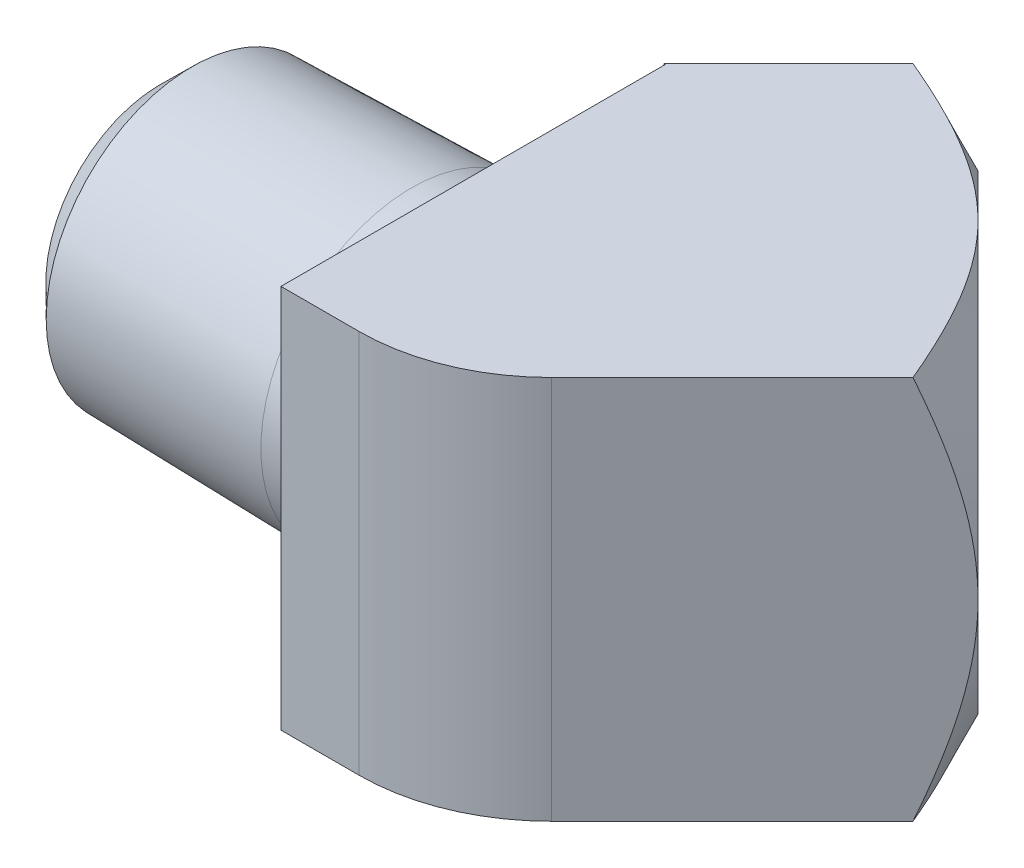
ISO-10303-21;
HEADER;
FILE_DESCRIPTION(('STEP AP214'),'2;1');
FILE_NAME('part.step','',(''),(''),'','','');
FILE_SCHEMA(('AUTOMOTIVE_DESIGN { 1 0 10303 214 1 1 1 1 }'));
ENDSEC;
DATA;
#1=APPLICATION_CONTEXT('core data for automotive mechanical design processes');
#2=APPLICATION_PROTOCOL_DEFINITION('international standard','automotive_design',2000,#1);
#3=PRODUCT_CONTEXT('',#1,'mechanical');
#4=PRODUCT('Part','Part','',(#3));
#5=PRODUCT_RELATED_PRODUCT_CATEGORY('part','',(#4));
#6=PRODUCT_DEFINITION_FORMATION('','',#4);
#7=PRODUCT_DEFINITION_CONTEXT('part definition',#1,'design');
#8=PRODUCT_DEFINITION('design','',#6,#7);
#9=PRODUCT_DEFINITION_SHAPE('','',#8);
#10=(LENGTH_UNIT() NAMED_UNIT(*) SI_UNIT(.MILLI.,.METRE.));
#11=(NAMED_UNIT(*) PLANE_ANGLE_UNIT() SI_UNIT($,.RADIAN.));
#12=(NAMED_UNIT(*) SI_UNIT($,.STERADIAN.) SOLID_ANGLE_UNIT());
#13=UNCERTAINTY_MEASURE_WITH_UNIT(LENGTH_MEASURE(1.E-05),#10,'distance_accuracy_value','');
#14=(GEOMETRIC_REPRESENTATION_CONTEXT(3) GLOBAL_UNCERTAINTY_ASSIGNED_CONTEXT((#13)) GLOBAL_UNIT_ASSIGNED_CONTEXT((#10,
#11,#12)) REPRESENTATION_CONTEXT('',''));
#15=CARTESIAN_POINT('',(0.,0.,0.));
#16=DIRECTION('',(0.,0.,1.));
#17=DIRECTION('',(1.,0.,0.));
#18=AXIS2_PLACEMENT_3D('',#15,#16,#17);
#19=CARTESIAN_POINT('',(4.71531024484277,0.,0.));
#20=DIRECTION('',(-1.,0.,0.));
#21=DIRECTION('',(0.,0.,1.));
#22=AXIS2_PLACEMENT_3D('',#19,#20,#21);
#23=CONICAL_SURFACE('',#22,6.70838061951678,1.02974425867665);
#24=CARTESIAN_POINT('',(6.35,0.,0.));
#25=DIRECTION('',(-1.,0.,0.));
#26=DIRECTION('',(0.,0.,1.));
#27=AXIS2_PLACEMENT_3D('',#24,#25,#26);
#28=CIRCLE('',#27,3.9878);
#29=CARTESIAN_POINT('',(6.35,-3.92255284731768,0.718420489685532));
#30=VERTEX_POINT('',#29);
#31=CARTESIAN_POINT('',(6.35,3.92255284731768,0.718420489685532));
#32=VERTEX_POINT('',#31);
#33=EDGE_CURVE('E105',#30,#32,#28,.T.);
#34=ORIENTED_EDGE('',*,*,#33,.T.);
#35=CARTESIAN_POINT('',(6.8580000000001,2.89313520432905,1.22642048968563));
#36=CARTESIAN_POINT('',(6.81837438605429,2.9815423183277,1.18679487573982));
#37=CARTESIAN_POINT('',(6.77792931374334,3.06920470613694,1.14634980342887));
#38=CARTESIAN_POINT('',(6.69563318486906,3.24314921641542,1.06405367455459));
#39=CARTESIAN_POINT('',(6.65378270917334,3.329431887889,1.02220319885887));
#40=CARTESIAN_POINT('',(6.56888131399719,3.5007873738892,0.937301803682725));
#41=CARTESIAN_POINT('',(6.52583054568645,3.58586033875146,0.894251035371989));
#42=CARTESIAN_POINT('',(6.43866731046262,3.75496550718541,0.807087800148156));
#43=CARTESIAN_POINT('',(6.39455441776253,3.83899727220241,0.76297490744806));
#44=CARTESIAN_POINT('',(6.35,3.92255284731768,0.718420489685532));
#45=B_SPLINE_CURVE_WITH_KNOTS('',3,(#35,#36,#37,#38,#39,#40,#41,#42,#43,#44),.UNSPECIFIED.,.F.,
.F.,(4,2,2,2,4),(0.,0.313994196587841,0.627860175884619,0.941686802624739,1.25564140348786),.UNSPECIFIED.);
#46=CARTESIAN_POINT('',(6.85800000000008,2.89313520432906,1.22642048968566));
#47=VERTEX_POINT('',#46);
#48=EDGE_CURVE('E22',#47,#32,#45,.T.);
#49=ORIENTED_EDGE('',*,*,#48,.F.);
#50=CARTESIAN_POINT('',(6.858,2.89313520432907,1.2264204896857));
#51=CARTESIAN_POINT('',(6.89515360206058,2.78795931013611,1.31611721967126));
#52=CARTESIAN_POINT('',(6.9308151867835,2.67906655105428,1.40221190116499));
#53=CARTESIAN_POINT('',(6.99869146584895,2.45381985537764,1.56607973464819));
#54=CARTESIAN_POINT('',(7.03089871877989,2.33745064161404,1.64383492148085));
#55=CARTESIAN_POINT('',(7.09141620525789,2.09697732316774,1.78993705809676));
#56=CARTESIAN_POINT('',(7.11970285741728,1.97283242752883,1.85822707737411));
#57=CARTESIAN_POINT('',(7.1715366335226,1.71805440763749,1.98336488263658));
#58=CARTESIAN_POINT('',(7.19508808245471,1.58742734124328,2.04022311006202));
#59=CARTESIAN_POINT('',(7.23160492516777,1.35422668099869,2.12838256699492));
#60=CARTESIAN_POINT('',(7.2457417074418,1.25289898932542,2.16251177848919));
#61=CARTESIAN_POINT('',(7.2708242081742,1.0475887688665,2.22306629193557));
#62=CARTESIAN_POINT('',(7.28177062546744,0.943606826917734,2.24949328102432));
#63=CARTESIAN_POINT('',(7.30025001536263,0.733934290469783,2.29410647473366));
#64=CARTESIAN_POINT('',(7.30779373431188,0.628250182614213,2.31231862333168));
#65=CARTESIAN_POINT('',(7.31937517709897,0.415573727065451,2.34027869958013));
#66=CARTESIAN_POINT('',(7.32341294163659,0.308581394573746,2.35002672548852));
#67=CARTESIAN_POINT('',(7.32790889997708,0.0937296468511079,2.36088092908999));
#68=CARTESIAN_POINT('',(7.3283553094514,-0.0141314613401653,2.36195865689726));
#69=CARTESIAN_POINT('',(7.32562886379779,-0.229539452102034,2.35537643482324));
#70=CARTESIAN_POINT('',(7.32245596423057,-0.337086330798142,2.34771637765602));
#71=CARTESIAN_POINT('',(7.31254998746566,-0.551135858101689,2.32380123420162));
#72=CARTESIAN_POINT('',(7.3058142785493,-0.657637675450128,2.30753979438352));
#73=CARTESIAN_POINT('',(7.28891508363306,-0.868781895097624,2.26674152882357));
#74=CARTESIAN_POINT('',(7.27875029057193,-0.973423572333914,2.2422015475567));
#75=CARTESIAN_POINT('',(7.24397434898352,-1.2782621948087,2.15824499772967));
#76=CARTESIAN_POINT('',(7.2148031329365,-1.47500497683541,2.08781945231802));
#77=CARTESIAN_POINT('',(7.14582459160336,-1.85522502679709,1.92129052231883));
#78=CARTESIAN_POINT('',(7.10600986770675,-2.03869295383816,1.82516927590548));
#79=CARTESIAN_POINT('',(7.0315366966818,-2.33511354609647,1.64537513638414));
#80=CARTESIAN_POINT('',(6.99918853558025,-2.45211027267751,1.56727976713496));
#81=CARTESIAN_POINT('',(6.9310540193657,-2.67833322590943,1.40278849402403));
#82=CARTESIAN_POINT('',(6.8952815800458,-2.78758800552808,1.3164261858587));
#83=CARTESIAN_POINT('',(6.858,-2.89313520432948,1.22642048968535));
#84=B_SPLINE_CURVE_WITH_KNOTS('',3,(#50,#51,#52,#53,#54,#55,#56,#57,#58,#59,#60,#61,#62,#63,#64,
#65,#66,#67,#68,#69,#70,#71,#72,#73,#74,#75,#76,#77,#78,#79,#80,#81,#82,#83),.UNSPECIFIED.,.F.,
.F.,(4,2,2,2,2,2,2,2,2,2,2,2,2,2,2,2,4),(0.,0.429437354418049,0.859781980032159,
1.29261204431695,1.72504496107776,2.04827588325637,2.37143594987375,2.69356814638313,
3.01569660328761,3.33888163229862,3.66207062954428,3.98549868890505,4.30905016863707,
4.93932424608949,5.57003758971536,6.00258672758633,6.43344718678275),.UNSPECIFIED.);
#85=CARTESIAN_POINT('',(6.85799999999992,-2.89313520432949,1.22642048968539));
#86=VERTEX_POINT('',#85);
#87=EDGE_CURVE('E117',#47,#86,#84,.T.);
#88=ORIENTED_EDGE('',*,*,#87,.T.);
#89=CARTESIAN_POINT('',(6.35,-3.92255284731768,0.718420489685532));
#90=CARTESIAN_POINT('',(6.39455441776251,-3.83899727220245,0.762974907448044));
#91=CARTESIAN_POINT('',(6.43866731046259,-3.75496550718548,0.807087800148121));
#92=CARTESIAN_POINT('',(6.52583054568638,-3.5858603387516,0.894251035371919));
#93=CARTESIAN_POINT('',(6.5688813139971,-3.50078737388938,0.937301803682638));
#94=CARTESIAN_POINT('',(6.65378270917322,-3.32943188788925,1.02220319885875));
#95=CARTESIAN_POINT('',(6.69563318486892,-3.24314921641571,1.06405367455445));
#96=CARTESIAN_POINT('',(6.77792931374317,-3.06920470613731,1.1463498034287));
#97=CARTESIAN_POINT('',(6.8183743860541,-2.98154231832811,1.18679487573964));
#98=CARTESIAN_POINT('',(6.8579999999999,-2.8931352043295,1.22642048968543));
#99=B_SPLINE_CURVE_WITH_KNOTS('',3,(#89,#90,#91,#92,#93,#94,#95,#96,#97,#98),.UNSPECIFIED.,.F.,
.F.,(4,2,2,2,4),(0.,0.31395460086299,0.627781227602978,0.941647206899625,1.25564140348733),.UNSPECIFIED.);
#100=EDGE_CURVE('E115',#30,#86,#99,.T.);
#101=ORIENTED_EDGE('',*,*,#100,.F.);
#102=EDGE_LOOP('',(#34,#49,#88,#101));
#103=FACE_BOUND('',#102,.T.);
#104=ADVANCED_FACE('F17',(#103),#23,.F.);
#105=CARTESIAN_POINT('',(5.99264234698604,0.,0.357357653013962));
#106=DIRECTION('',(0.707106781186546,0.,-0.707106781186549));
#107=DIRECTION('',(-0.707106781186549,0.,-0.707106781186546));
#108=AXIS2_PLACEMENT_3D('',#105,#106,#107);
#109=CONICAL_SURFACE('',#108,3.14670636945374,1.02974425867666);
#110=CARTESIAN_POINT('',(5.99078975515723,0.,0.359210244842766));
#111=DIRECTION('',(0.707106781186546,0.,-0.707106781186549));
#112=DIRECTION('',(-0.707106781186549,0.,-0.707106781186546));
#113=AXIS2_PLACEMENT_3D('',#110,#111,#112);
#114=CIRCLE('',#113,3.14234602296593);
#115=EDGE_CURVE('E110',#47,#86,#114,.T.);
#116=ORIENTED_EDGE('',*,*,#115,.T.);
#117=ORIENTED_EDGE('',*,*,#87,.F.);
#118=EDGE_LOOP('',(#116,#117));
#119=FACE_BOUND('',#118,.T.);
#120=ADVANCED_FACE('F343',(#119),#109,.F.);
#121=CARTESIAN_POINT('',(5.99078975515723,0.,0.359210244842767));
#122=DIRECTION('',(-0.707106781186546,0.,0.707106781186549));
#123=DIRECTION('',(0.707106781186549,0.,0.707106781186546));
#124=AXIS2_PLACEMENT_3D('',#121,#122,#123);
#125=PLANE('',#124);
#126=ORIENTED_EDGE('',*,*,#115,.F.);
#127=ORIENTED_EDGE('',*,*,#48,.T.);
#128=CARTESIAN_POINT('',(5.63157951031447,0.,0.));
#129=DIRECTION('',(-0.707106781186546,0.,0.707106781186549));
#130=DIRECTION('',(0.707106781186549,0.,0.707106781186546));
#131=AXIS2_PLACEMENT_3D('',#128,#129,#130);
#132=ELLIPSE('',#131,5.63960084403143,3.9878);
#133=CARTESIAN_POINT('',(2.40268962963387,2.34026045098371,-3.22888988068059));
#134=VERTEX_POINT('',#133);
#135=EDGE_CURVE('E102',#32,#134,#132,.T.);
#136=ORIENTED_EDGE('',*,*,#135,.T.);
#137=CARTESIAN_POINT('',(5.99078975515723,0.,0.359210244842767));
#138=DIRECTION('',(-0.707106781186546,0.,0.707106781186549));
#139=DIRECTION('',(0.707106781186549,0.,0.707106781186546));
#140=AXIS2_PLACEMENT_3D('',#137,#138,#139);
#141=CIRCLE('',#140,5.588);
#142=CARTESIAN_POINT('',(2.40268962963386,-2.34026045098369,-3.22888988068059));
#143=VERTEX_POINT('',#142);
#144=EDGE_CURVE('E323',#134,#143,#141,.F.);
#145=ORIENTED_EDGE('',*,*,#144,.T.);
#146=CARTESIAN_POINT('',(5.63157951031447,0.,0.));
#147=DIRECTION('',(-0.707106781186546,0.,0.707106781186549));
#148=DIRECTION('',(0.707106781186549,0.,0.707106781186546));
#149=AXIS2_PLACEMENT_3D('',#146,#147,#148);
#150=ELLIPSE('',#149,5.63960084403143,3.9878);
#151=EDGE_CURVE('E109',#143,#30,#150,.T.);
#152=ORIENTED_EDGE('',*,*,#151,.T.);
#153=ORIENTED_EDGE('',*,*,#100,.T.);
#154=EDGE_LOOP('',(#126,#127,#136,#145,#152,#153));
#155=FACE_BOUND('',#154,.T.);
#156=ADVANCED_FACE('F113',(#155),#125,.F.);
#157=CARTESIAN_POINT('',(-13.4239,0.,0.));
#158=DIRECTION('',(1.,0.,0.));
#159=DIRECTION('',(0.,0.,-1.));
#160=AXIS2_PLACEMENT_3D('',#157,#158,#159);
#161=CYLINDRICAL_SURFACE('',#160,3.9878);
#162=ORIENTED_EDGE('',*,*,#135,.F.);
#163=ORIENTED_EDGE('',*,*,#33,.F.);
#164=ORIENTED_EDGE('',*,*,#151,.F.);
#165=CARTESIAN_POINT('',(2.40268962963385,-2.3402604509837,-3.22888988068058));
#166=CARTESIAN_POINT('',(2.40920531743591,-2.25016483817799,-3.2942078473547));
#167=CARTESIAN_POINT('',(2.41432998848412,-2.1572675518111,-3.35576851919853));
#168=CARTESIAN_POINT('',(2.42246848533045,-1.96659340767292,-3.47094124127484));
#169=CARTESIAN_POINT('',(2.42548254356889,-1.86881708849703,-3.52455416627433));
#170=CARTESIAN_POINT('',(2.43006781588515,-1.66927677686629,-3.62331874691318));
#171=CARTESIAN_POINT('',(2.43164173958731,-1.56752065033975,-3.66848616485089));
#172=CARTESIAN_POINT('',(2.43386747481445,-1.36061026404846,-3.75015553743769));
#173=CARTESIAN_POINT('',(2.43451935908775,-1.25545627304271,-3.78665817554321));
#174=CARTESIAN_POINT('',(2.43562361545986,-0.962996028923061,-3.87464072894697));
#175=CARTESIAN_POINT('',(2.4355652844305,-0.772865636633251,-3.91701027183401));
#176=CARTESIAN_POINT('',(2.43534331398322,-0.388451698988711,-3.97358776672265));
#177=CARTESIAN_POINT('',(2.43517966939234,-0.194167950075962,-3.98779433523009));
#178=CARTESIAN_POINT('',(2.43517170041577,0.111872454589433,-3.98780326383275));
#179=CARTESIAN_POINT('',(2.43522143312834,0.223706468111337,-3.98309233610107));
#180=CARTESIAN_POINT('',(2.43536358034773,0.446574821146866,-3.96429203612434));
#181=CARTESIAN_POINT('',(2.43545598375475,0.557609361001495,-3.95020510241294));
#182=CARTESIAN_POINT('',(2.43553664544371,0.778183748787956,-3.9127365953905));
#183=CARTESIAN_POINT('',(2.43552482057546,0.887722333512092,-3.88934761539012));
#184=CARTESIAN_POINT('',(2.43514217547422,1.1044012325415,-3.83345233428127));
#185=CARTESIAN_POINT('',(2.43477151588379,1.21154259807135,-3.80095011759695));
#186=CARTESIAN_POINT('',(2.43340862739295,1.40833527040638,-3.73208818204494));
#187=CARTESIAN_POINT('',(2.4325078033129,1.49838328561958,-3.69685452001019));
#188=CARTESIAN_POINT('',(2.42986439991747,1.67566431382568,-3.61994923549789));
#189=CARTESIAN_POINT('',(2.42812193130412,1.76289769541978,-3.57827846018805));
#190=CARTESIAN_POINT('',(2.42343335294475,1.93402943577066,-3.48875239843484));
#191=CARTESIAN_POINT('',(2.42048800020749,2.01792985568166,-3.44090101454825));
#192=CARTESIAN_POINT('',(2.41294272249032,2.18200921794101,-3.33926912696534));
#193=CARTESIAN_POINT('',(2.40834237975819,2.26218721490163,-3.28548712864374));
#194=CARTESIAN_POINT('',(2.40268962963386,2.34026045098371,-3.22888988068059));
#195=B_SPLINE_CURVE_WITH_KNOTS('',3,(#165,#166,#167,#168,#169,#170,#171,#172,#173,#174,#175,
#176,#177,#178,#179,#180,#181,#182,#183,#184,#185,#186,#187,#188,#189,#190,#191,#192,#193,#194),
.UNSPECIFIED.,.F.,.F.,(4,2,2,2,2,2,2,2,2,2,2,2,2,2,4),(0.,0.334284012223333,0.668531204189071,
1.00214820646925,1.33573888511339,1.91792711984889,2.50014395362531,2.83559594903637,
3.17096073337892,3.50659308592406,3.84207525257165,4.13192456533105,4.42173576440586,
4.71136485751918,5.00106711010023),.UNSPECIFIED.);
#196=EDGE_CURVE('E107',#143,#134,#195,.T.);
#197=ORIENTED_EDGE('',*,*,#196,.T.);
#198=EDGE_LOOP('',(#162,#163,#164,#197));
#199=FACE_BOUND('',#198,.T.);
#200=CARTESIAN_POINT('',(-11.43,0.,0.));
#201=DIRECTION('',(1.,0.,0.));
#202=DIRECTION('',(0.,0.,-1.));
#203=AXIS2_PLACEMENT_3D('',#200,#201,#202);
#204=CIRCLE('',#203,3.9878);
#205=CARTESIAN_POINT('',(-11.43,0.,-3.98779999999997));
#206=VERTEX_POINT('',#205);
#207=EDGE_CURVE('E324',#206,#206,#204,.F.);
#208=ORIENTED_EDGE('',*,*,#207,.T.);
#209=EDGE_LOOP('',(#208));
#210=FACE_BOUND('',#209,.T.);
#211=ADVANCED_FACE('F19',(#199,#210),#161,.F.);
#212=CARTESIAN_POINT('',(-11.43,0.,0.));
#213=DIRECTION('',(1.,0.,0.));
#214=DIRECTION('',(0.,0.,-1.));
#215=AXIS2_PLACEMENT_3D('',#212,#213,#214);
#216=PLANE('',#215);
#217=ORIENTED_EDGE('',*,*,#207,.F.);
#218=EDGE_LOOP('',(#217));
#219=FACE_BOUND('',#218,.T.);
#220=CARTESIAN_POINT('',(-11.4300000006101,0.,0.));
#221=DIRECTION('',(1.,0.,0.));
#222=DIRECTION('',(0.,0.,-1.));
#223=AXIS2_PLACEMENT_3D('',#220,#221,#222);
#224=CIRCLE('',#223,5.20700000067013);
#225=CARTESIAN_POINT('',(-11.4300000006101,0.,-5.2070000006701));
#226=VERTEX_POINT('',#225);
#227=EDGE_CURVE('E191',#226,#226,#224,.T.);
#228=ORIENTED_EDGE('',*,*,#227,.F.);
#229=EDGE_LOOP('',(#228));
#230=FACE_BOUND('',#229,.T.);
#231=ADVANCED_FACE('F337',(#219,#230),#216,.F.);
#232=CARTESIAN_POINT('',(16.0486766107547,0.,-9.6986766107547));
#233=DIRECTION('',(-0.707106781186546,0.,0.707106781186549));
#234=DIRECTION('',(0.707106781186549,0.,0.707106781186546));
#235=AXIS2_PLACEMENT_3D('',#232,#233,#234);
#236=CYLINDRICAL_SURFACE('',#235,5.588);
#237=CARTESIAN_POINT('',(7.96644610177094,0.,-1.61644610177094));
#238=DIRECTION('',(0.707106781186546,0.,-0.707106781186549));
#239=DIRECTION('',(0.707106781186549,0.,0.707106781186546));
#240=AXIS2_PLACEMENT_3D('',#237,#238,#239);
#241=CIRCLE('',#240,5.58800000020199);
#242=CARTESIAN_POINT('',(11.9177587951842,0.,2.3348665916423));
#243=VERTEX_POINT('',#242);
#244=EDGE_CURVE('E122',#243,#243,#241,.T.);
#245=ORIENTED_EDGE('',*,*,#244,.T.);
#246=EDGE_LOOP('',(#245));
#247=FACE_BOUND('',#246,.T.);
#248=ORIENTED_EDGE('',*,*,#144,.F.);
#249=ORIENTED_EDGE('',*,*,#196,.F.);
#250=EDGE_LOOP('',(#248,#249));
#251=FACE_BOUND('',#250,.T.);
#252=ADVANCED_FACE('F331',(#247,#251),#236,.F.);
#253=CARTESIAN_POINT('',(-9.9821999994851,0.,0.));
#254=DIRECTION('',(1.,0.,0.));
#255=DIRECTION('',(0.,0.,-1.));
#256=AXIS2_PLACEMENT_3D('',#253,#254,#255);
#257=CONICAL_SURFACE('',#256,6.63617333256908,0.778923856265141);
#258=CARTESIAN_POINT('',(-9.98220000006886,0.,0.));
#259=DIRECTION('',(1.,0.,0.));
#260=DIRECTION('',(0.,0.,1.));
#261=AXIS2_PLACEMENT_3D('',#258,#259,#260);
#262=CIRCLE('',#261,6.636173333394);
#263=CARTESIAN_POINT('',(-9.98220000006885,0.,6.63617333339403));
#264=VERTEX_POINT('',#263);
#265=EDGE_CURVE('E313',#264,#264,#262,.T.);
#266=ORIENTED_EDGE('',*,*,#265,.F.);
#267=EDGE_LOOP('',(#266));
#268=FACE_BOUND('',#267,.T.);
#269=ORIENTED_EDGE('',*,*,#227,.T.);
#270=EDGE_LOOP('',(#269));
#271=FACE_BOUND('',#270,.T.);
#272=ADVANCED_FACE('F336',(#268,#271),#257,.T.);
#273=CARTESIAN_POINT('',(15.2491285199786,0.,-8.8991285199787));
#274=DIRECTION('',(0.707106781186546,0.,-0.707106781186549));
#275=DIRECTION('',(-0.707106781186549,0.,-0.707106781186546));
#276=AXIS2_PLACEMENT_3D('',#273,#274,#275);
#277=CONICAL_SURFACE('',#276,5.90860869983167,0.0311192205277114);
#278=CARTESIAN_POINT('',(15.2491285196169,0.,-8.89912851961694));
#279=DIRECTION('',(0.707106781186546,0.,-0.707106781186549));
#280=DIRECTION('',(0.707106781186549,0.,0.707106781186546));
#281=AXIS2_PLACEMENT_3D('',#278,#279,#280);
#282=CIRCLE('',#281,5.90860870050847);
#283=CARTESIAN_POINT('',(19.4271457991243,0.,-4.72111124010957));
#284=VERTEX_POINT('',#283);
#285=EDGE_CURVE('E303',#284,#284,#282,.T.);
#286=ORIENTED_EDGE('',*,*,#285,.T.);
#287=EDGE_LOOP('',(#286));
#288=FACE_BOUND('',#287,.T.);
#289=ORIENTED_EDGE('',*,*,#244,.F.);
#290=EDGE_LOOP('',(#289));
#291=FACE_BOUND('',#290,.T.);
#292=ADVANCED_FACE('F461',(#288,#291),#277,.F.);
#293=CARTESIAN_POINT('',(-6.61519450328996E-11,0.,0.));
#294=DIRECTION('',(1.,0.,0.));
#295=DIRECTION('',(0.,0.,-1.));
#296=AXIS2_PLACEMENT_3D('',#293,#294,#295);
#297=CONICAL_SURFACE('',#296,6.85799999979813,0.0222185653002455);
#298=CARTESIAN_POINT('',(-2.74086309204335E-13,0.,0.));
#299=DIRECTION('',(1.,0.,0.));
#300=DIRECTION('',(0.,0.,-1.));
#301=AXIS2_PLACEMENT_3D('',#298,#299,#300);
#302=CIRCLE('',#301,6.858);
#303=CARTESIAN_POINT('',(-2.85887868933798E-13,0.,-6.85799999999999));
#304=VERTEX_POINT('',#303);
#305=EDGE_CURVE('E190',#304,#304,#302,.T.);
#306=ORIENTED_EDGE('',*,*,#305,.F.);
#307=EDGE_LOOP('',(#306));
#308=FACE_BOUND('',#307,.T.);
#309=ORIENTED_EDGE('',*,*,#265,.T.);
#310=EDGE_LOOP('',(#309));
#311=FACE_BOUND('',#310,.T.);
#312=ADVANCED_FACE('F453',(#308,#311),#297,.T.);
#313=CARTESIAN_POINT('',(16.0486766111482,0.,-9.69867661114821));
#314=DIRECTION('',(0.707106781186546,0.,-0.707106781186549));
#315=DIRECTION('',(-0.707106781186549,0.,-0.707106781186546));
#316=AXIS2_PLACEMENT_3D('',#313,#314,#315);
#317=CONICAL_SURFACE('',#316,7.11199999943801,0.816517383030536);
#318=CARTESIAN_POINT('',(16.0486766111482,0.,-9.69867661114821));
#319=DIRECTION('',(0.707106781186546,0.,-0.707106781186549));
#320=DIRECTION('',(-0.707106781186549,0.,-0.707106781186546));
#321=AXIS2_PLACEMENT_3D('',#318,#319,#320);
#322=CIRCLE('',#321,7.11199999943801);
#323=CARTESIAN_POINT('',(11.0197331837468,0.,-14.7276200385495));
#324=VERTEX_POINT('',#323);
#325=EDGE_CURVE('E573',#324,#324,#322,.F.);
#326=ORIENTED_EDGE('',*,*,#325,.F.);
#327=EDGE_LOOP('',(#326));
#328=FACE_BOUND('',#327,.T.);
#329=ORIENTED_EDGE('',*,*,#285,.F.);
#330=EDGE_LOOP('',(#329));
#331=FACE_BOUND('',#330,.T.);
#332=ADVANCED_FACE('F198',(#328,#331),#317,.F.);
#333=CARTESIAN_POINT('',(14.5622659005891,0.,-8.21226590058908));
#334=DIRECTION('',(-0.707106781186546,0.,0.707106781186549));
#335=DIRECTION('',(0.707106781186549,0.,0.707106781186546));
#336=AXIS2_PLACEMENT_3D('',#333,#334,#335);
#337=CONICAL_SURFACE('',#336,12.378547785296,1.04719755);
#338=CARTESIAN_POINT('',(9.87026040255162,0.,-15.8770928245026));
#339=CARTESIAN_POINT('',(9.87026263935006,-0.126117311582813,-15.8770950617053));
#340=CARTESIAN_POINT('',(9.86914535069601,-0.25222917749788,-15.8759777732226));
#341=CARTESIAN_POINT('',(9.86469198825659,-0.504371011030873,-15.8715244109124));
#342=CARTESIAN_POINT('',(9.86135597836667,-0.63040098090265,-15.8681884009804));
#343=CARTESIAN_POINT('',(9.84805421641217,-1.0081574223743,-15.8548866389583));
#344=CARTESIAN_POINT('',(9.83479469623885,-1.25966570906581,-15.841627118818));
#345=CARTESIAN_POINT('',(9.79995034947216,-1.76070885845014,-15.8067827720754));
#346=CARTESIAN_POINT('',(9.77839171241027,-2.01024743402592,-15.7852241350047));
#347=CARTESIAN_POINT('',(9.72755288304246,-2.50775841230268,-15.7343853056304));
#348=CARTESIAN_POINT('',(9.6982720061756,-2.75573067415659,-15.7051044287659));
#349=CARTESIAN_POINT('',(9.63305686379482,-3.24725353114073,-15.6398892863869));
#350=CARTESIAN_POINT('',(9.59719448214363,-3.49082333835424,-15.6040269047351));
#351=CARTESIAN_POINT('',(9.5193699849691,-3.97598550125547,-15.5262024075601));
#352=CARTESIAN_POINT('',(9.47740791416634,-4.21757787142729,-15.4842403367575));
#353=CARTESIAN_POINT('',(9.34343555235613,-4.93967874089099,-15.3502679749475));
#354=CARTESIAN_POINT('',(9.24337911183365,-5.4172226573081,-15.2502115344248));
#355=CARTESIAN_POINT('',(9.08046067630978,-6.13105387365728,-15.0872930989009));
#356=CARTESIAN_POINT('',(9.0235921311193,-6.37017042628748,-15.0304245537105));
#357=CARTESIAN_POINT('',(8.90627743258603,-6.84655269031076,-14.9131098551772));
#358=CARTESIAN_POINT('',(8.84583261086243,-7.083819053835,-14.8526650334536));
#359=CARTESIAN_POINT('',(8.72151273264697,-7.5580082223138,-14.7283451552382));
#360=CARTESIAN_POINT('',(8.6576207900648,-7.79492212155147,-14.664453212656));
#361=CARTESIAN_POINT('',(8.52710778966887,-8.26731516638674,-14.5339402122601));
#362=CARTESIAN_POINT('',(8.46048601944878,-8.50279391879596,-14.46731844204));
#363=CARTESIAN_POINT('',(8.39271494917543,-8.73759999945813,-14.3995473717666));
#364=B_SPLINE_CURVE_WITH_KNOTS('',3,(#338,#339,#340,#341,#342,#343,#344,#345,#346,#347,#348,
#349,#350,#351,#352,#353,#354,#355,#356,#357,#358,#359,#360,#361,#362,#363),.UNSPECIFIED.,.F.,
.F.,(4,2,2,2,2,2,2,2,2,2,2,2,4),(0.,0.378331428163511,0.756651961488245,1.51294756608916,
2.26687583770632,3.02087096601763,3.76707422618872,4.51327201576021,6.00654740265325,
6.76335400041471,7.5198805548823,8.28052654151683,9.04137231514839),.UNSPECIFIED.);
#365=CARTESIAN_POINT('',(9.8702604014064,0.,-15.8770928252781));
#366=VERTEX_POINT('',#365);
#367=CARTESIAN_POINT('',(8.39271494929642,-8.7376,-14.3995473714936));
#368=VERTEX_POINT('',#367);
#369=EDGE_CURVE('E203',#366,#368,#364,.T.);
#370=ORIENTED_EDGE('',*,*,#369,.F.);
#371=CARTESIAN_POINT('',(16.0486766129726,0.,-9.69867661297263));
#372=DIRECTION('',(-0.707106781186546,0.,0.707106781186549));
#373=DIRECTION('',(0.707106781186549,0.,0.707106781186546));
#374=AXIS2_PLACEMENT_3D('',#371,#372,#373);
#375=CIRCLE('',#374,8.73760000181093);
#376=CARTESIAN_POINT('',(16.0486766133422,-8.73760000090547,-9.69867661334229));
#377=VERTEX_POINT('',#376);
#378=EDGE_CURVE('E571',#377,#366,#375,.F.);
#379=ORIENTED_EDGE('',*,*,#378,.F.);
#380=CARTESIAN_POINT('',(8.39271494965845,-8.73760000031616,-14.3995473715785));
#381=CARTESIAN_POINT('',(8.56664538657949,-8.73760000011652,-14.3264575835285));
#382=CARTESIAN_POINT('',(8.74019466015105,-8.73760000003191,-14.2524618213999));
#383=CARTESIAN_POINT('',(9.08642783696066,-8.73759999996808,-14.102450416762));
#384=CARTESIAN_POINT('',(9.25911169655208,-8.73759999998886,-14.0264346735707));
#385=CARTESIAN_POINT('',(9.77584887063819,-8.73760000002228,-13.7949830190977));
#386=CARTESIAN_POINT('',(10.1184215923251,-8.73760000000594,-13.6362120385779));
#387=CARTESIAN_POINT('',(10.7951417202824,-8.73759999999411,-13.3094123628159));
#388=CARTESIAN_POINT('',(11.1293382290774,-8.73759999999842,-13.1414858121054));
#389=CARTESIAN_POINT('',(11.7910061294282,-8.73760000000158,-12.792805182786));
#390=CARTESIAN_POINT('',(12.1184777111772,-8.73760000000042,-12.6120514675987));
#391=CARTESIAN_POINT('',(12.7663297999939,-8.73759999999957,-12.2342510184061));
#392=CARTESIAN_POINT('',(13.0866619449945,-8.73759999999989,-12.0371208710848));
#393=CARTESIAN_POINT('',(13.7155856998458,-8.73760000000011,-11.6250136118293));
#394=CARTESIAN_POINT('',(14.0241816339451,-8.73760000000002,-11.4100431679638));
#395=CARTESIAN_POINT('',(14.4773763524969,-8.73759999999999,-11.07174716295));
#396=CARTESIAN_POINT('',(14.6274915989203,-8.7376,-10.9557719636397));
#397=CARTESIAN_POINT('',(14.923584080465,-8.7376,-10.7186488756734));
#398=CARTESIAN_POINT('',(15.0695614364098,-8.7376,-10.5975011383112));
#399=CARTESIAN_POINT('',(15.3572257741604,-8.7376,-10.3497798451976));
#400=CARTESIAN_POINT('',(15.4989059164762,-8.7376,-10.223198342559));
#401=CARTESIAN_POINT('',(15.7774688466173,-8.7376,-9.96482569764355));
#402=CARTESIAN_POINT('',(15.9143509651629,-8.7376,-9.83303383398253));
#403=CARTESIAN_POINT('',(16.0486766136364,-8.7376,-9.69867661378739));
#404=B_SPLINE_CURVE_WITH_KNOTS('',3,(#380,#381,#382,#383,#384,#385,#386,#387,#388,#389,#390,
#391,#392,#393,#394,#395,#396,#397,#398,#399,#400,#401,#402,#403),.UNSPECIFIED.,.F.,.F.,(4,2,2,
2,2,2,2,2,2,2,2,4),(0.,0.565985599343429,1.13199946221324,2.26456728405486,3.38638797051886,
4.50817688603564,5.63607839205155,6.76356021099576,7.33255313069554,7.90152941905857,
8.4713682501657,9.04128625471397),.UNSPECIFIED.);
#405=EDGE_CURVE('E181',#368,#377,#404,.T.);
#406=ORIENTED_EDGE('',*,*,#405,.F.);
#407=EDGE_LOOP('',(#370,#379,#406));
#408=FACE_BOUND('',#407,.T.);
#409=ADVANCED_FACE('F193',(#408),#337,.T.);
#410=CARTESIAN_POINT('',(-11.43,8.7376,-8.7376));
#411=DIRECTION('',(0.,0.,-1.));
#412=DIRECTION('',(-1.,0.,0.));
#413=AXIS2_PLACEMENT_3D('',#410,#411,#412);
#414=PLANE('',#413);
#415=DIRECTION('',(-1.,0.,0.));
#416=VECTOR('',#415,1.);
#417=CARTESIAN_POINT('',(2.794,-8.7376,-8.7376));
#418=LINE('',#417,#416);
#419=CARTESIAN_POINT('',(2.794,-8.7376,-8.7376));
#420=VERTEX_POINT('',#419);
#421=CARTESIAN_POINT('',(2.73076757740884,-8.7376,-8.7376));
#422=VERTEX_POINT('',#421);
#423=EDGE_CURVE('E180',#420,#422,#418,.T.);
#424=ORIENTED_EDGE('',*,*,#423,.F.);
#425=DIRECTION('',(0.,1.,0.));
#426=VECTOR('',#425,1.);
#427=CARTESIAN_POINT('',(2.794,0.,-8.7376));
#428=LINE('',#427,#426);
#429=CARTESIAN_POINT('',(2.794,8.7376,-8.7376));
#430=VERTEX_POINT('',#429);
#431=EDGE_CURVE('E278',#420,#430,#428,.T.);
#432=ORIENTED_EDGE('',*,*,#431,.T.);
#433=DIRECTION('',(-1.,0.,0.));
#434=VECTOR('',#433,1.);
#435=CARTESIAN_POINT('',(-11.43,8.7376,-8.7376));
#436=LINE('',#435,#434);
#437=CARTESIAN_POINT('',(2.73076757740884,8.7376,-8.7376));
#438=VERTEX_POINT('',#437);
#439=EDGE_CURVE('E300',#438,#430,#436,.F.);
#440=ORIENTED_EDGE('',*,*,#439,.F.);
#441=DIRECTION('',(0.,1.,0.));
#442=VECTOR('',#441,1.);
#443=CARTESIAN_POINT('',(2.73076757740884,8.7376,-8.7376));
#444=LINE('',#443,#442);
#445=EDGE_CURVE('E286',#422,#438,#444,.T.);
#446=ORIENTED_EDGE('',*,*,#445,.F.);
#447=EDGE_LOOP('',(#424,#432,#440,#446));
#448=FACE_BOUND('',#447,.T.);
#449=ADVANCED_FACE('F197',(#448),#414,.F.);
#450=CARTESIAN_POINT('',(-11.43,0.,0.));
#451=DIRECTION('',(1.,0.,0.));
#452=DIRECTION('',(0.,0.,-1.));
#453=AXIS2_PLACEMENT_3D('',#450,#451,#452);
#454=CYLINDRICAL_SURFACE('',#453,6.858);
#455=ORIENTED_EDGE('',*,*,#305,.T.);
#456=EDGE_LOOP('',(#455));
#457=FACE_BOUND('',#456,.T.);
#458=CARTESIAN_POINT('',(2.794,0.,0.));
#459=DIRECTION('',(1.,0.,0.));
#460=DIRECTION('',(0.,0.,-1.));
#461=AXIS2_PLACEMENT_3D('',#458,#459,#460);
#462=CIRCLE('',#461,6.858);
#463=CARTESIAN_POINT('',(2.79399999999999,0.,-6.85799999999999));
#464=VERTEX_POINT('',#463);
#465=EDGE_CURVE('E271',#464,#464,#462,.F.);
#466=ORIENTED_EDGE('',*,*,#465,.T.);
#467=EDGE_LOOP('',(#466));
#468=FACE_BOUND('',#467,.T.);
#469=ADVANCED_FACE('F166',(#457,#468),#454,.T.);
#470=CARTESIAN_POINT('',(14.5622659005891,0.,-8.21226590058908));
#471=DIRECTION('',(-0.707106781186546,0.,0.707106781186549));
#472=DIRECTION('',(0.707106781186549,0.,0.707106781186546));
#473=AXIS2_PLACEMENT_3D('',#470,#471,#472);
#474=CONICAL_SURFACE('',#473,12.378547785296,1.04719755);
#475=CARTESIAN_POINT('',(16.0486766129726,0.,-9.69867661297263));
#476=DIRECTION('',(-0.707106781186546,0.,0.707106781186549));
#477=DIRECTION('',(0.707106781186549,0.,0.707106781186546));
#478=AXIS2_PLACEMENT_3D('',#475,#476,#477);
#479=CIRCLE('',#478,8.73760000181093);
#480=CARTESIAN_POINT('',(22.2270928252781,0.,-3.52026040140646));
#481=VERTEX_POINT('',#480);
#482=EDGE_CURVE('E182',#481,#377,#479,.F.);
#483=ORIENTED_EDGE('',*,*,#482,.F.);
#484=CARTESIAN_POINT('',(20.7495473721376,-8.73759999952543,-2.04271494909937));
#485=CARTESIAN_POINT('',(20.799967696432,-8.56293032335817,-2.09313527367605));
#486=CARTESIAN_POINT('',(20.8497444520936,-8.38788954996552,-2.14291202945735));
#487=CARTESIAN_POINT('',(20.9478553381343,-8.0369916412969,-2.24102291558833));
#488=CARTESIAN_POINT('',(20.9961893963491,-7.86113446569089,-2.28935697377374));
#489=CARTESIAN_POINT('',(21.1388321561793,-7.3320850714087,-2.43199973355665));
#490=CARTESIAN_POINT('',(21.2307330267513,-6.97758153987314,-2.52390060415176));
#491=CARTESIAN_POINT('',(21.4056932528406,-6.26798588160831,-2.69886083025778));
#492=CARTESIAN_POINT('',(21.4888282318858,-5.9129312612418,-2.78199580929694));
#493=CARTESIAN_POINT('',(21.6453218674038,-5.19850696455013,-2.93848944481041));
#494=CARTESIAN_POINT('',(21.7186808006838,-4.83913741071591,-3.01184837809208));
#495=CARTESIAN_POINT('',(21.8537066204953,-4.11389154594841,-3.14687419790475));
#496=CARTESIAN_POINT('',(21.9153076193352,-3.74799045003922,-3.2084751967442));
#497=CARTESIAN_POINT('',(22.0237158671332,-3.01187036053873,-3.31688344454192));
#498=CARTESIAN_POINT('',(22.0705286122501,-2.64165302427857,-3.36369618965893));
#499=CARTESIAN_POINT('',(22.127977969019,-2.0819845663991,-3.42114554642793));
#500=CARTESIAN_POINT('',(22.1450479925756,-1.89383020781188,-3.43821556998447));
#501=CARTESIAN_POINT('',(22.1745326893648,-1.51678986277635,-3.46770026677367));
#502=CARTESIAN_POINT('',(22.1869474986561,-1.32790389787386,-3.48011507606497));
#503=CARTESIAN_POINT('',(22.2069190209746,-0.949329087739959,-3.50008659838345));
#504=CARTESIAN_POINT('',(22.2144683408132,-0.759639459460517,-3.50763591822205));
#505=CARTESIAN_POINT('',(22.224563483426,-0.379968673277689,-3.51773106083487));
#506=CARTESIAN_POINT('',(22.2271086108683,-0.189987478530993,-3.52027618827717));
#507=CARTESIAN_POINT('',(22.2270928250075,-1.06711209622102E-10,-3.52026040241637));
#508=B_SPLINE_CURVE_WITH_KNOTS('',3,(#484,#485,#486,#487,#488,#489,#490,#491,#492,#493,#494,
#495,#496,#497,#498,#499,#500,#501,#502,#503,#504,#505,#506,#507),.UNSPECIFIED.,.F.,.F.,(4,2,2,
2,2,2,2,2,2,2,2,4),(0.,0.565985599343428,1.13199946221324,2.26456728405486,3.38638797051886,
4.50817688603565,5.63607839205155,6.76356021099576,7.33255313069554,7.90152941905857,
8.4713682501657,9.04128625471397),.UNSPECIFIED.);
#509=CARTESIAN_POINT('',(20.749547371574,-8.73759999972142,-2.04271494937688));
#510=VERTEX_POINT('',#509);
#511=EDGE_CURVE('E151',#510,#481,#508,.T.);
#512=ORIENTED_EDGE('',*,*,#511,.F.);
#513=CARTESIAN_POINT('',(16.0486766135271,-8.73759999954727,-9.69867661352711));
#514=CARTESIAN_POINT('',(16.1378572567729,-8.73759999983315,-9.60950044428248));
#515=CARTESIAN_POINT('',(16.2259145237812,-8.7375999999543,-9.51920860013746));
#516=CARTESIAN_POINT('',(16.3997523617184,-8.7376000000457,-9.33646403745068));
#517=CARTESIAN_POINT('',(16.4855329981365,-8.73760000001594,-9.24401138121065));
#518=CARTESIAN_POINT('',(16.7393453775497,-8.73759999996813,-8.96359547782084));
#519=CARTESIAN_POINT('',(16.903929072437,-8.73759999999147,-8.77249274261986));
#520=CARTESIAN_POINT('',(17.2233757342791,-8.7376000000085,-8.38335738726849));
#521=CARTESIAN_POINT('',(17.3782675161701,-8.73760000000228,-8.18534833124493));
#522=CARTESIAN_POINT('',(17.6792220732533,-8.73759999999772,-7.78271611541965));
#523=CARTESIAN_POINT('',(17.8252840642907,-8.73759999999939,-7.57809237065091));
#524=CARTESIAN_POINT('',(18.1076280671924,-8.7376000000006,-7.16531808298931));
#525=CARTESIAN_POINT('',(18.2439955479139,-8.73760000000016,-6.95722583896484));
#526=CARTESIAN_POINT('',(18.5092325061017,-8.73759999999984,-6.53633988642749));
#527=CARTESIAN_POINT('',(18.6381020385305,-8.73759999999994,-6.32354621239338));
#528=CARTESIAN_POINT('',(19.0147320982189,-8.73760000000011,-5.6789714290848));
#529=CARTESIAN_POINT('',(19.2523501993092,-8.73760000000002,-5.24124044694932));
#530=CARTESIAN_POINT('',(19.5941866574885,-8.73759999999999,-4.57356711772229));
#531=CARTESIAN_POINT('',(19.7063990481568,-8.7376,-4.34761763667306));
#532=CARTESIAN_POINT('',(19.9259374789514,-8.7376,-3.89344980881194));
#533=CARTESIAN_POINT('',(20.0332653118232,-8.7376,-3.66523233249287));
#534=CARTESIAN_POINT('',(20.2442478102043,-8.7376,-3.20561007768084));
#535=CARTESIAN_POINT('',(20.3478792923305,-8.7376,-2.97419471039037));
#536=CARTESIAN_POINT('',(20.5513986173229,-8.7376,-2.50964938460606));
#537=CARTESIAN_POINT('',(20.6512854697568,-8.7376,-2.27651899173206));
#538=CARTESIAN_POINT('',(20.7495473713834,-8.7376,-2.04271494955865));
#539=B_SPLINE_CURVE_WITH_KNOTS('',3,(#513,#514,#515,#516,#517,#518,#519,#520,#521,#522,#523,
#524,#525,#526,#527,#528,#529,#530,#531,#532,#533,#534,#535,#536,#537,#538),.UNSPECIFIED.,.F.,
.F.,(4,2,2,2,2,2,2,2,2,2,2,2,4),(0.,0.37833142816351,0.756651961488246,1.51294756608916,
2.26687583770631,3.02087096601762,3.7670742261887,4.51327201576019,6.00654740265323,
6.7633540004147,7.51988055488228,8.28052654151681,9.04137231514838),.UNSPECIFIED.);
#540=EDGE_CURVE('E173',#377,#510,#539,.T.);
#541=ORIENTED_EDGE('',*,*,#540,.F.);
#542=EDGE_LOOP('',(#483,#512,#541));
#543=FACE_BOUND('',#542,.T.);
#544=ADVANCED_FACE('F160',(#543),#474,.T.);
#545=CARTESIAN_POINT('',(0.171583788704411,-8.7376,-6.17841621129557));
#546=DIRECTION('',(0.,-1.,0.));
#547=DIRECTION('',(-0.707106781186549,0.,-0.707106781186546));
#548=AXIS2_PLACEMENT_3D('',#545,#546,#547);
#549=PLANE('',#548);
#550=ORIENTED_EDGE('',*,*,#423,.T.);
#551=DIRECTION('',(-0.707106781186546,0.,0.707106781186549));
#552=VECTOR('',#551,1.);
#553=CARTESIAN_POINT('',(0.171583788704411,-8.7376,-6.17841621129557));
#554=LINE('',#553,#552);
#555=EDGE_CURVE('E211',#368,#422,#554,.T.);
#556=ORIENTED_EDGE('',*,*,#555,.F.);
#557=ORIENTED_EDGE('',*,*,#405,.T.);
#558=ORIENTED_EDGE('',*,*,#540,.T.);
#559=DIRECTION('',(0.707106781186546,0.,-0.707106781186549));
#560=VECTOR('',#559,1.);
#561=CARTESIAN_POINT('',(12.5284162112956,-8.7376,6.17841621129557));
#562=LINE('',#561,#560);
#563=CARTESIAN_POINT('',(12.5284162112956,-8.7376,6.17841621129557));
#564=VERTEX_POINT('',#563);
#565=EDGE_CURVE('E150',#564,#510,#562,.T.);
#566=ORIENTED_EDGE('',*,*,#565,.F.);
#567=CARTESIAN_POINT('',(6.35,-8.7376,0.));
#568=DIRECTION('',(0.,-1.,0.));
#569=DIRECTION('',(-0.707106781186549,0.,-0.707106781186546));
#570=AXIS2_PLACEMENT_3D('',#567,#568,#569);
#571=CIRCLE('',#570,8.7376);
#572=CARTESIAN_POINT('',(6.35,-8.7376,8.7376));
#573=VERTEX_POINT('',#572);
#574=EDGE_CURVE('E158',#573,#564,#571,.F.);
#575=ORIENTED_EDGE('',*,*,#574,.F.);
#576=DIRECTION('',(1.,0.,0.));
#577=VECTOR('',#576,1.);
#578=CARTESIAN_POINT('',(6.35,-8.7376,8.7376));
#579=LINE('',#578,#577);
#580=CARTESIAN_POINT('',(2.794,-8.7376,8.7376));
#581=VERTEX_POINT('',#580);
#582=EDGE_CURVE('E267',#581,#573,#579,.T.);
#583=ORIENTED_EDGE('',*,*,#582,.F.);
#584=DIRECTION('',(0.,0.,-1.));
#585=VECTOR('',#584,1.);
#586=CARTESIAN_POINT('',(2.794,-8.7376,0.));
#587=LINE('',#586,#585);
#588=EDGE_CURVE('E281',#581,#420,#587,.T.);
#589=ORIENTED_EDGE('',*,*,#588,.T.);
#590=EDGE_LOOP('',(#550,#556,#557,#558,#566,#575,#583,#589));
#591=FACE_BOUND('',#590,.T.);
#592=ADVANCED_FACE('F165',(#591),#549,.T.);
#593=CARTESIAN_POINT('',(16.0486766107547,0.,-9.6986766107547));
#594=DIRECTION('',(0.707106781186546,0.,-0.707106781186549));
#595=DIRECTION('',(-0.707106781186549,0.,-0.707106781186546));
#596=AXIS2_PLACEMENT_3D('',#593,#594,#595);
#597=PLANE('',#596);
#598=ORIENTED_EDGE('',*,*,#325,.T.);
#599=EDGE_LOOP('',(#598));
#600=FACE_BOUND('',#599,.T.);
#601=ORIENTED_EDGE('',*,*,#378,.T.);
#602=CARTESIAN_POINT('',(16.0486766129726,0.,-9.69867661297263));
#603=DIRECTION('',(-0.707106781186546,0.,0.707106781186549));
#604=DIRECTION('',(0.707106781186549,0.,0.707106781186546));
#605=AXIS2_PLACEMENT_3D('',#602,#603,#604);
#606=CIRCLE('',#605,8.73760000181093);
#607=CARTESIAN_POINT('',(16.0486766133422,8.73760000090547,-9.69867661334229));
#608=VERTEX_POINT('',#607);
#609=EDGE_CURVE('E212',#608,#366,#606,.T.);
#610=ORIENTED_EDGE('',*,*,#609,.F.);
#611=CARTESIAN_POINT('',(16.0486766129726,0.,-9.69867661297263));
#612=DIRECTION('',(-0.707106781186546,0.,0.707106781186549));
#613=DIRECTION('',(0.707106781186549,0.,0.707106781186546));
#614=AXIS2_PLACEMENT_3D('',#611,#612,#613);
#615=CIRCLE('',#614,8.73760000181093);
#616=EDGE_CURVE('E149',#481,#608,#615,.T.);
#617=ORIENTED_EDGE('',*,*,#616,.F.);
#618=ORIENTED_EDGE('',*,*,#482,.T.);
#619=EDGE_LOOP('',(#601,#610,#617,#618));
#620=FACE_BOUND('',#619,.T.);
#621=ADVANCED_FACE('F230',(#600,#620),#597,.T.);
#622=CARTESIAN_POINT('',(14.5622659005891,0.,-8.21226590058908));
#623=DIRECTION('',(-0.707106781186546,0.,0.707106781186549));
#624=DIRECTION('',(0.707106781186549,0.,0.707106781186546));
#625=AXIS2_PLACEMENT_3D('',#622,#623,#624);
#626=CONICAL_SURFACE('',#625,12.378547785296,1.04719755);
#627=CARTESIAN_POINT('',(16.0486766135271,8.73759999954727,-9.69867661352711));
#628=CARTESIAN_POINT('',(15.9595004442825,8.73759999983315,-9.78785725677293));
#629=CARTESIAN_POINT('',(15.8692086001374,8.7375999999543,-9.87591452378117));
#630=CARTESIAN_POINT('',(15.6864640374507,8.7376000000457,-10.0497523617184));
#631=CARTESIAN_POINT('',(15.5940113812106,8.73760000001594,-10.1355329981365));
#632=CARTESIAN_POINT('',(15.3135954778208,8.73759999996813,-10.3893453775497));
#633=CARTESIAN_POINT('',(15.1224927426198,8.73759999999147,-10.553929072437));
#634=CARTESIAN_POINT('',(14.7333573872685,8.7376000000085,-10.8733757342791));
#635=CARTESIAN_POINT('',(14.5353483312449,8.73760000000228,-11.0282675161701));
#636=CARTESIAN_POINT('',(14.1327161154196,8.73759999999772,-11.3292220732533));
#637=CARTESIAN_POINT('',(13.9280923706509,8.73759999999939,-11.4752840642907));
#638=CARTESIAN_POINT('',(13.5153180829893,8.7376000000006,-11.7576280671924));
#639=CARTESIAN_POINT('',(13.3072258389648,8.73760000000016,-11.8939955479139));
#640=CARTESIAN_POINT('',(12.8863398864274,8.73759999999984,-12.1592325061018));
#641=CARTESIAN_POINT('',(12.6735462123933,8.73759999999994,-12.2881020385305));
#642=CARTESIAN_POINT('',(12.0289714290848,8.73760000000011,-12.6647320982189));
#643=CARTESIAN_POINT('',(11.5912404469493,8.73760000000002,-12.9023501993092));
#644=CARTESIAN_POINT('',(10.9235671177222,8.73759999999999,-13.2441866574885));
#645=CARTESIAN_POINT('',(10.697617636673,8.7376,-13.3563990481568));
#646=CARTESIAN_POINT('',(10.2434498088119,8.7376,-13.5759374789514));
#647=CARTESIAN_POINT('',(10.0152323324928,8.7376,-13.6832653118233));
#648=CARTESIAN_POINT('',(9.55561007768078,8.7376,-13.8942478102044));
#649=CARTESIAN_POINT('',(9.32419471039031,8.7376,-13.9978792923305));
#650=CARTESIAN_POINT('',(8.859649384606,8.7376,-14.2013986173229));
#651=CARTESIAN_POINT('',(8.626518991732,8.7376,-14.3012854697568));
#652=CARTESIAN_POINT('',(8.39271494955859,8.7376,-14.3995473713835));
#653=B_SPLINE_CURVE_WITH_KNOTS('',3,(#627,#628,#629,#630,#631,#632,#633,#634,#635,#636,#637,
#638,#639,#640,#641,#642,#643,#644,#645,#646,#647,#648,#649,#650,#651,#652),.UNSPECIFIED.,.F.,
.F.,(4,2,2,2,2,2,2,2,2,2,2,2,4),(0.,0.378331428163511,0.756651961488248,1.51294756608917,
2.26687583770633,3.02087096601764,3.76707422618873,4.51327201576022,6.00654740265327,
6.76335400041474,7.51988055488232,8.28052654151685,9.04137231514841),.UNSPECIFIED.);
#654=CARTESIAN_POINT('',(8.39271494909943,8.73759999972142,-14.3995473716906));
#655=VERTEX_POINT('',#654);
#656=EDGE_CURVE('E233',#608,#655,#653,.T.);
#657=ORIENTED_EDGE('',*,*,#656,.F.);
#658=ORIENTED_EDGE('',*,*,#609,.T.);
#659=CARTESIAN_POINT('',(8.39271494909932,8.73759999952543,-14.3995473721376));
#660=CARTESIAN_POINT('',(8.443135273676,8.56293032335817,-14.449967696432));
#661=CARTESIAN_POINT('',(8.49291202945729,8.38788954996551,-14.4997444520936));
#662=CARTESIAN_POINT('',(8.59102291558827,8.03699164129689,-14.5978553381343));
#663=CARTESIAN_POINT('',(8.63935697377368,7.86113446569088,-14.6461893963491));
#664=CARTESIAN_POINT('',(8.78199973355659,7.33208507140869,-14.7888321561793));
#665=CARTESIAN_POINT('',(8.8739006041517,6.97758153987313,-14.8807330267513));
#666=CARTESIAN_POINT('',(9.04886083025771,6.26798588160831,-15.0556932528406));
#667=CARTESIAN_POINT('',(9.13199580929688,5.9129312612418,-15.1388282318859));
#668=CARTESIAN_POINT('',(9.28848944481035,5.19850696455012,-15.2953218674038));
#669=CARTESIAN_POINT('',(9.36184837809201,4.83913741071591,-15.3686808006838));
#670=CARTESIAN_POINT('',(9.49687419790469,4.1138915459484,-15.5037066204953));
#671=CARTESIAN_POINT('',(9.55847519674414,3.74799045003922,-15.5653076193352));
#672=CARTESIAN_POINT('',(9.66688344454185,3.01187036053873,-15.6737158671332));
#673=CARTESIAN_POINT('',(9.71369618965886,2.64165302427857,-15.7205286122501));
#674=CARTESIAN_POINT('',(9.77114554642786,2.0819845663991,-15.7779779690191));
#675=CARTESIAN_POINT('',(9.7882155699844,1.89383020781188,-15.7950479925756));
#676=CARTESIAN_POINT('',(9.8177002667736,1.51678986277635,-15.8245326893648));
#677=CARTESIAN_POINT('',(9.8301150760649,1.32790389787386,-15.8369474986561));
#678=CARTESIAN_POINT('',(9.85008659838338,0.949329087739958,-15.8569190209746));
#679=CARTESIAN_POINT('',(9.85763591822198,0.759639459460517,-15.8644683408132));
#680=CARTESIAN_POINT('',(9.8677310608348,0.379968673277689,-15.874563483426));
#681=CARTESIAN_POINT('',(9.8702761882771,0.189987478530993,-15.8771086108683));
#682=CARTESIAN_POINT('',(9.87026040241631,1.06711209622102E-10,-15.8770928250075));
#683=B_SPLINE_CURVE_WITH_KNOTS('',3,(#659,#660,#661,#662,#663,#664,#665,#666,#667,#668,#669,
#670,#671,#672,#673,#674,#675,#676,#677,#678,#679,#680,#681,#682),.UNSPECIFIED.,.F.,.F.,(4,2,2,
2,2,2,2,2,2,2,2,4),(0.,0.565985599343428,1.13199946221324,2.26456728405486,3.38638797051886,
4.50817688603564,5.63607839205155,6.76356021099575,7.33255313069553,7.90152941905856,
8.47136825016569,9.04128625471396),.UNSPECIFIED.);
#684=EDGE_CURVE('E213',#655,#366,#683,.T.);
#685=ORIENTED_EDGE('',*,*,#684,.F.);
#686=EDGE_LOOP('',(#657,#658,#685));
#687=FACE_BOUND('',#686,.T.);
#688=ADVANCED_FACE('F224',(#687),#626,.T.);
#689=CARTESIAN_POINT('',(0.171583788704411,8.7376,-6.17841621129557));
#690=DIRECTION('',(-0.707106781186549,0.,-0.707106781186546));
#691=DIRECTION('',(-0.707106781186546,0.,0.707106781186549));
#692=AXIS2_PLACEMENT_3D('',#689,#690,#691);
#693=PLANE('',#692);
#694=DIRECTION('',(0.707106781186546,0.,-0.707106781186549));
#695=VECTOR('',#694,1.);
#696=CARTESIAN_POINT('',(0.171583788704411,8.7376,-6.17841621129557));
#697=LINE('',#696,#695);
#698=EDGE_CURVE('E238',#655,#438,#697,.F.);
#699=ORIENTED_EDGE('',*,*,#698,.F.);
#700=ORIENTED_EDGE('',*,*,#684,.T.);
#701=ORIENTED_EDGE('',*,*,#369,.T.);
#702=ORIENTED_EDGE('',*,*,#555,.T.);
#703=ORIENTED_EDGE('',*,*,#445,.T.);
#704=EDGE_LOOP('',(#699,#700,#701,#702,#703));
#705=FACE_BOUND('',#704,.T.);
#706=ADVANCED_FACE('F219',(#705),#693,.T.);
#707=CARTESIAN_POINT('',(2.794,0.,0.));
#708=DIRECTION('',(1.,0.,0.));
#709=DIRECTION('',(0.,0.,-1.));
#710=AXIS2_PLACEMENT_3D('',#707,#708,#709);
#711=PLANE('',#710);
#712=ORIENTED_EDGE('',*,*,#465,.F.);
#713=EDGE_LOOP('',(#712));
#714=FACE_BOUND('',#713,.T.);
#715=DIRECTION('',(0.,0.,1.));
#716=VECTOR('',#715,1.);
#717=CARTESIAN_POINT('',(2.794,8.7376,-8.7376));
#718=LINE('',#717,#716);
#719=CARTESIAN_POINT('',(2.794,8.7376,8.7376));
#720=VERTEX_POINT('',#719);
#721=EDGE_CURVE('E242',#430,#720,#718,.T.);
#722=ORIENTED_EDGE('',*,*,#721,.F.);
#723=ORIENTED_EDGE('',*,*,#431,.F.);
#724=ORIENTED_EDGE('',*,*,#588,.F.);
#725=DIRECTION('',(0.,1.,0.));
#726=VECTOR('',#725,1.);
#727=CARTESIAN_POINT('',(2.794,8.7376,8.7376));
#728=LINE('',#727,#726);
#729=EDGE_CURVE('E268',#720,#581,#728,.F.);
#730=ORIENTED_EDGE('',*,*,#729,.F.);
#731=EDGE_LOOP('',(#722,#723,#724,#730));
#732=FACE_BOUND('',#731,.T.);
#733=ADVANCED_FACE('F223',(#714,#732),#711,.F.);
#734=CARTESIAN_POINT('',(6.35,8.7376,8.7376));
#735=DIRECTION('',(0.,0.,1.));
#736=DIRECTION('',(1.,0.,0.));
#737=AXIS2_PLACEMENT_3D('',#734,#735,#736);
#738=PLANE('',#737);
#739=DIRECTION('',(0.,-1.,0.));
#740=VECTOR('',#739,1.);
#741=CARTESIAN_POINT('',(6.35,0.,8.7376));
#742=LINE('',#741,#740);
#743=CARTESIAN_POINT('',(6.35,8.7376,8.7376));
#744=VERTEX_POINT('',#743);
#745=EDGE_CURVE('E264',#744,#573,#742,.T.);
#746=ORIENTED_EDGE('',*,*,#745,.F.);
#747=DIRECTION('',(1.,0.,0.));
#748=VECTOR('',#747,1.);
#749=CARTESIAN_POINT('',(2.794,8.7376,8.7376));
#750=LINE('',#749,#748);
#751=EDGE_CURVE('E254',#720,#744,#750,.T.);
#752=ORIENTED_EDGE('',*,*,#751,.F.);
#753=ORIENTED_EDGE('',*,*,#729,.T.);
#754=ORIENTED_EDGE('',*,*,#582,.T.);
#755=EDGE_LOOP('',(#746,#752,#753,#754));
#756=FACE_BOUND('',#755,.T.);
#757=ADVANCED_FACE('F383',(#756),#738,.T.);
#758=CARTESIAN_POINT('',(6.35,0.,0.));
#759=DIRECTION('',(0.,-1.,0.));
#760=DIRECTION('',(-0.707106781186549,0.,-0.707106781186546));
#761=AXIS2_PLACEMENT_3D('',#758,#759,#760);
#762=CYLINDRICAL_SURFACE('',#761,8.7376);
#763=DIRECTION('',(0.,1.,0.));
#764=VECTOR('',#763,1.);
#765=CARTESIAN_POINT('',(12.5284162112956,-8.7376,6.17841621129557));
#766=LINE('',#765,#764);
#767=CARTESIAN_POINT('',(12.5284162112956,8.7376,6.17841621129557));
#768=VERTEX_POINT('',#767);
#769=EDGE_CURVE('E157',#768,#564,#766,.F.);
#770=ORIENTED_EDGE('',*,*,#769,.F.);
#771=CARTESIAN_POINT('',(6.35,8.7376,0.));
#772=DIRECTION('',(0.,-1.,0.));
#773=DIRECTION('',(-0.707106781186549,0.,-0.707106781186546));
#774=AXIS2_PLACEMENT_3D('',#771,#772,#773);
#775=CIRCLE('',#774,8.7376);
#776=EDGE_CURVE('E130',#744,#768,#775,.F.);
#777=ORIENTED_EDGE('',*,*,#776,.F.);
#778=ORIENTED_EDGE('',*,*,#745,.T.);
#779=ORIENTED_EDGE('',*,*,#574,.T.);
#780=EDGE_LOOP('',(#770,#777,#778,#779));
#781=FACE_BOUND('',#780,.T.);
#782=ADVANCED_FACE('F376',(#781),#762,.T.);
#783=CARTESIAN_POINT('',(12.5284162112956,-8.7376,6.17841621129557));
#784=DIRECTION('',(0.707106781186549,0.,0.707106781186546));
#785=DIRECTION('',(0.707106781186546,0.,-0.707106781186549));
#786=AXIS2_PLACEMENT_3D('',#783,#784,#785);
#787=PLANE('',#786);
#788=ORIENTED_EDGE('',*,*,#769,.T.);
#789=ORIENTED_EDGE('',*,*,#565,.T.);
#790=ORIENTED_EDGE('',*,*,#511,.T.);
#791=CARTESIAN_POINT('',(20.7495473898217,8.73759993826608,-2.04271496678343));
#792=CARTESIAN_POINT('',(20.7999677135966,8.56293026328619,-2.09313529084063));
#793=CARTESIAN_POINT('',(20.84974446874,8.38788949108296,-2.14291204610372));
#794=CARTESIAN_POINT('',(20.9478553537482,8.03699158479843,-2.24102293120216));
#795=CARTESIAN_POINT('',(20.9961894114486,7.86113441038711,-2.28935698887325));
#796=CARTESIAN_POINT('',(21.1388321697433,7.3320850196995,-2.43199974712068));
#797=CARTESIAN_POINT('',(21.2307330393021,6.97758149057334,-2.5239006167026));
#798=CARTESIAN_POINT('',(21.4056932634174,6.26798583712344,-2.69886084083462));
#799=CARTESIAN_POINT('',(21.4888282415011,5.91293121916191,-2.78199581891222));
#800=CARTESIAN_POINT('',(21.6453218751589,5.19850692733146,-2.9384894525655));
#801=CARTESIAN_POINT('',(21.7186808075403,4.83913737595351,-3.01184838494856));
#802=CARTESIAN_POINT('',(21.8537066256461,4.11389151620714,-3.14687420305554));
#803=CARTESIAN_POINT('',(21.9153076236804,3.74799042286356,-3.20847520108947));
#804=CARTESIAN_POINT('',(22.0237158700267,3.01187033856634,-3.31688344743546));
#805=CARTESIAN_POINT('',(22.0705286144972,2.64165300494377,-3.36369619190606));
#806=CARTESIAN_POINT('',(22.1279779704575,2.08198455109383,-3.42114554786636));
#807=CARTESIAN_POINT('',(22.1450479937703,1.89383019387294,-3.43821557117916));
#808=CARTESIAN_POINT('',(22.1745326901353,1.51678985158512,-3.46770026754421));
#809=CARTESIAN_POINT('',(22.1869474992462,1.327903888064,-3.48011507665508));
#810=CARTESIAN_POINT('',(22.2069190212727,0.949329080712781,-3.50008659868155));
#811=CARTESIAN_POINT('',(22.214468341,0.75963945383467,-3.50763591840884));
#812=CARTESIAN_POINT('',(22.2245634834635,0.379968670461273,-3.51773106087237));
#813=CARTESIAN_POINT('',(22.2271086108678,0.189987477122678,-3.52027618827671));
#814=CARTESIAN_POINT('',(22.2270928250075,1.06711739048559E-10,-3.52026040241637));
#815=B_SPLINE_CURVE_WITH_KNOTS('',3,(#791,#792,#793,#794,#795,#796,#797,#798,#799,#800,#801,
#802,#803,#804,#805,#806,#807,#808,#809,#810,#811,#812,#813,#814),.UNSPECIFIED.,.F.,.F.,(4,2,2,
2,2,2,2,2,2,2,2,4),(0.,0.565985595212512,1.13199945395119,2.26456726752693,3.38638794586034,
4.50817685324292,5.63607835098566,6.76356016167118,7.33255307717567,7.90152936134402,
8.47136818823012,9.04128618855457),.UNSPECIFIED.);
#816=CARTESIAN_POINT('',(20.7495473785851,8.73759996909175,-2.04271496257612));
#817=VERTEX_POINT('',#816);
#818=EDGE_CURVE('E42',#817,#481,#815,.T.);
#819=ORIENTED_EDGE('',*,*,#818,.F.);
#820=DIRECTION('',(0.707106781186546,0.,-0.707106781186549));
#821=VECTOR('',#820,1.);
#822=CARTESIAN_POINT('',(12.5284162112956,8.7376,6.17841621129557));
#823=LINE('',#822,#821);
#824=EDGE_CURVE('E33',#768,#817,#823,.T.);
#825=ORIENTED_EDGE('',*,*,#824,.F.);
#826=EDGE_LOOP('',(#788,#789,#790,#819,#825));
#827=FACE_BOUND('',#826,.T.);
#828=ADVANCED_FACE('F138',(#827),#787,.T.);
#829=CARTESIAN_POINT('',(14.5622659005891,0.,-8.21226590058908));
#830=DIRECTION('',(-0.707106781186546,0.,0.707106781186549));
#831=DIRECTION('',(0.707106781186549,0.,0.707106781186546));
#832=AXIS2_PLACEMENT_3D('',#829,#830,#831);
#833=CONICAL_SURFACE('',#832,12.378547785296,1.04719755);
#834=ORIENTED_EDGE('',*,*,#616,.T.);
#835=CARTESIAN_POINT('',(20.749547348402,8.73759996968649,-2.04271495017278));
#836=CARTESIAN_POINT('',(20.6764575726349,8.73759998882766,-2.21664539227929));
#837=CARTESIAN_POINT('',(20.6024618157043,8.73759999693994,-2.39019466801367));
#838=CARTESIAN_POINT('',(20.4524504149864,8.73760000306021,-2.7364278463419));
#839=CARTESIAN_POINT('',(20.3764346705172,8.73760000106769,-2.90911170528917));
#840=CARTESIAN_POINT('',(20.1449830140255,8.73759999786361,-3.42584887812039));
#841=CARTESIAN_POINT('',(19.9862120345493,8.73759999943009,-3.76842159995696));
#842=CARTESIAN_POINT('',(19.6594123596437,8.73760000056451,-4.44514172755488));
#843=CARTESIAN_POINT('',(19.4914858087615,8.73760000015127,-4.77933823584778));
#844=CARTESIAN_POINT('',(19.1428051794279,8.73759999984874,-5.44100613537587));
#845=CARTESIAN_POINT('',(18.9620514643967,8.73759999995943,-5.7684777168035));
#846=CARTESIAN_POINT('',(18.5842510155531,8.73760000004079,-6.41632980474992));
#847=CARTESIAN_POINT('',(18.3871208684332,8.73760000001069,-6.73666194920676));
#848=CARTESIAN_POINT('',(17.9750136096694,8.73759999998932,-7.36558570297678));
#849=CARTESIAN_POINT('',(17.760043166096,8.73759999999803,-7.67418163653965));
#850=CARTESIAN_POINT('',(17.4217471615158,8.73760000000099,-8.12737635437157));
#851=CARTESIAN_POINT('',(17.305771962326,8.73760000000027,-8.27749160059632));
#852=CARTESIAN_POINT('',(17.0686488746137,8.73759999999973,-8.57358408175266));
#853=CARTESIAN_POINT('',(16.947501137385,8.73759999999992,-8.7195614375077));
#854=CARTESIAN_POINT('',(16.6997798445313,8.73760000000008,-9.0072257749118));
#855=CARTESIAN_POINT('',(16.5731983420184,8.73760000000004,-9.14890591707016));
#856=CARTESIAN_POINT('',(16.314825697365,8.73759999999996,-9.42746884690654));
#857=CARTESIAN_POINT('',(16.1830338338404,8.73759999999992,-9.5643509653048));
#858=CARTESIAN_POINT('',(16.0486766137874,8.7376,-9.69867661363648));
#859=B_SPLINE_CURVE_WITH_KNOTS('',3,(#835,#836,#837,#838,#839,#840,#841,#842,#843,#844,#845,
#846,#847,#848,#849,#850,#851,#852,#853,#854,#855,#856,#857,#858),.UNSPECIFIED.,.F.,.F.,(4,2,2,
2,2,2,2,2,2,2,2,4),(0.,0.565985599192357,1.13199946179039,2.26456728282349,3.38638796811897,
4.50817688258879,5.63607838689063,6.7635602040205,7.3325531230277,7.90152941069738,
8.47136824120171,9.04128624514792),.UNSPECIFIED.);
#860=EDGE_CURVE('E11',#817,#608,#859,.T.);
#861=ORIENTED_EDGE('',*,*,#860,.F.);
#862=ORIENTED_EDGE('',*,*,#818,.T.);
#863=EDGE_LOOP('',(#834,#861,#862));
#864=FACE_BOUND('',#863,.T.);
#865=ADVANCED_FACE('F134',(#864),#833,.T.);
#866=CARTESIAN_POINT('',(12.5284162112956,8.7376,6.17841621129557));
#867=DIRECTION('',(0.,1.,0.));
#868=DIRECTION('',(0.707106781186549,0.,0.707106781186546));
#869=AXIS2_PLACEMENT_3D('',#866,#867,#868);
#870=PLANE('',#869);
#871=ORIENTED_EDGE('',*,*,#824,.T.);
#872=ORIENTED_EDGE('',*,*,#860,.T.);
#873=ORIENTED_EDGE('',*,*,#656,.T.);
#874=ORIENTED_EDGE('',*,*,#698,.T.);
#875=ORIENTED_EDGE('',*,*,#439,.T.);
#876=ORIENTED_EDGE('',*,*,#721,.T.);
#877=ORIENTED_EDGE('',*,*,#751,.T.);
#878=ORIENTED_EDGE('',*,*,#776,.T.);
#879=EDGE_LOOP('',(#871,#872,#873,#874,#875,#876,#877,#878));
#880=FACE_BOUND('',#879,.T.);
#881=ADVANCED_FACE('F132',(#880),#870,.T.);
#882=CLOSED_SHELL('',(#104,#120,#156,#211,#231,#252,#272,#292,#312,#332,#409,#449,#469,#544,
#592,#621,#688,#706,#733,#757,#782,#828,#865,#881));
#883=MANIFOLD_SOLID_BREP('B1',#882);
#884=ADVANCED_BREP_SHAPE_REPRESENTATION('',(#18,#883),#14);
#885=SHAPE_DEFINITION_REPRESENTATION(#9,#884);
ENDSEC;
END-ISO-10303-21;
